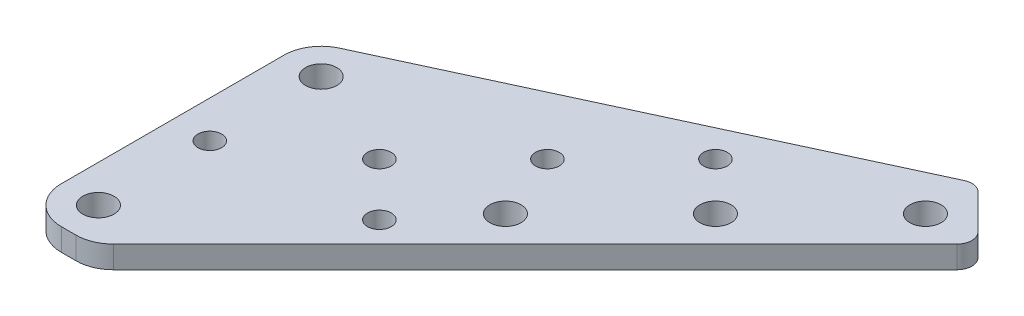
from build123d import *

# Parameters (mm, degrees)
SKETCH_1_R      = 2.1
SKETCH_1_R_2    = 1.6
EXTRUDE_1_DEPTH = 3
FILLET_1_R      = 2
FILLET_2_R      = 5


with BuildPart() as part:
    # Sketch 1 → Extrude 1 (new body)
    with BuildSketch(Plane(origin=(0, 0, 0), x_dir=(1, 0, 0), z_dir=(0, 1, 0))):
        with BuildLine():
            Line((-173.241161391, -180.312229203), (-180.312229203, -173.241161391))
            Line((-180.312229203, -173.241161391), (-239.100913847, -200.462802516))
            ThreePointArc((-239.100913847, -200.462802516), (-241.213346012, -202.307841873), (-242, -205))
            Line((-242, -205), (-242, -235))
            ThreePointArc((-242, -235), (-240.535533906, -238.535533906), (-237, -240))
            Line((-237, -240), (-232.928932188, -240))
            Line((-232.928932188, -240), (-173.241161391, -180.312229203))
        make_face()
        with Locations(Location((-208.59650045, -208.59650045, 0), (0, 0, 270))):
            Circle(SKETCH_1_R, mode=Mode.SUBTRACT)
        with Locations(Location((-194.454364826, -194.454364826, 0), (0, 0, 270))):
            Circle(SKETCH_1_R, mode=Mode.SUBTRACT)
        with Locations(Location((-180.312229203, -180.312229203, 0), (0, 0, 270))):
            Circle(SKETCH_1_R, mode=Mode.SUBTRACT)
        with Locations(Location((-237, -235, 0), (0, 0, 270))):
            Circle(SKETCH_1_R, mode=Mode.SUBTRACT)
        with Locations(Location((-237, -220, 0), (0, 0, 270))):
            Circle(SKETCH_1_R_2, mode=Mode.SUBTRACT)
        with Locations(Location((-237, -205, 0), (0, 0, 270))):
            Circle(SKETCH_1_R, mode=Mode.SUBTRACT)
        with Locations(Location((-200.818325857, -188.090403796, 0), (0, 0, 270))):
            Circle(SKETCH_1_R_2, mode=Mode.SUBTRACT)
        with Locations(Location((-212.132034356, -199.404112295, 0), (0, 0, 270))):
            Circle(SKETCH_1_R_2, mode=Mode.SUBTRACT)
        with Locations(Location((-223.445742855, -210.717820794, 0), (0, 0, 270))):
            Circle(SKETCH_1_R_2, mode=Mode.SUBTRACT)
        with Locations(Location((-216.374675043, -217.788888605, 0), (0, 0, 270))):
            Circle(SKETCH_1_R_2, mode=Mode.SUBTRACT)
    extrude(amount=EXTRUDE_1_DEPTH)

    # Fillet 1
    fillet_1_edges = [part.edges().sort_by_distance(p)[0] for p in [
        (-180.312229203, 1.5, 173.241161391),
        (-173.241161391, 1.5, 180.312229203),
    ]]
    fillet(fillet_1_edges, radius=FILLET_1_R)

    # Fillet 2
    fillet_2_edges = [part.edges().sort_by_distance(p)[0] for p in [
        (-232.928932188, 1.5, 240),
    ]]
    fillet(fillet_2_edges, radius=FILLET_2_R)


solid = part.part
